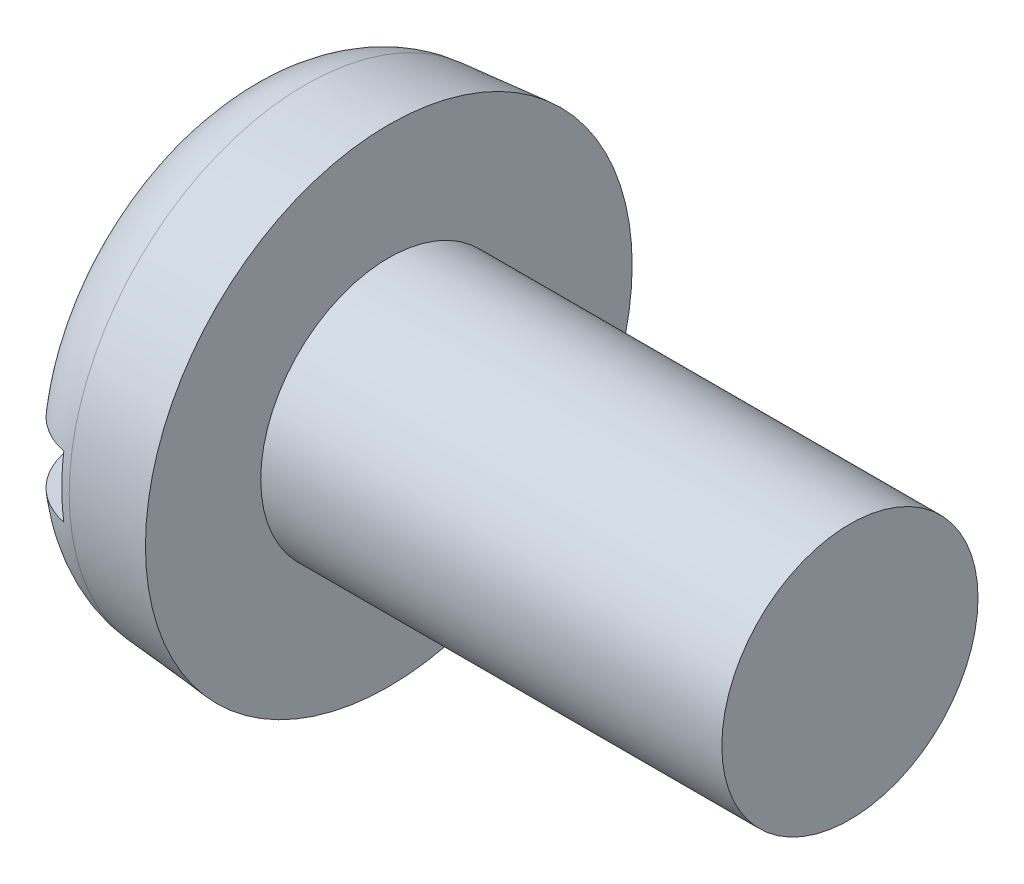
ISO-10303-21;
HEADER;
FILE_DESCRIPTION(('STEP AP214'),'2;1');
FILE_NAME('part.step','',(''),(''),'','','');
FILE_SCHEMA(('AUTOMOTIVE_DESIGN { 1 0 10303 214 1 1 1 1 }'));
ENDSEC;
DATA;
#1=APPLICATION_CONTEXT('core data for automotive mechanical design processes');
#2=APPLICATION_PROTOCOL_DEFINITION('international standard','automotive_design',2000,#1);
#3=PRODUCT_CONTEXT('',#1,'mechanical');
#4=PRODUCT('Part','Part','',(#3));
#5=PRODUCT_RELATED_PRODUCT_CATEGORY('part','',(#4));
#6=PRODUCT_DEFINITION_FORMATION('','',#4);
#7=PRODUCT_DEFINITION_CONTEXT('part definition',#1,'design');
#8=PRODUCT_DEFINITION('design','',#6,#7);
#9=PRODUCT_DEFINITION_SHAPE('','',#8);
#10=(LENGTH_UNIT() NAMED_UNIT(*) SI_UNIT(.MILLI.,.METRE.));
#11=(NAMED_UNIT(*) PLANE_ANGLE_UNIT() SI_UNIT($,.RADIAN.));
#12=(NAMED_UNIT(*) SI_UNIT($,.STERADIAN.) SOLID_ANGLE_UNIT());
#13=UNCERTAINTY_MEASURE_WITH_UNIT(LENGTH_MEASURE(1.E-05),#10,'distance_accuracy_value','');
#14=(GEOMETRIC_REPRESENTATION_CONTEXT(3) GLOBAL_UNCERTAINTY_ASSIGNED_CONTEXT((#13)) GLOBAL_UNIT_ASSIGNED_CONTEXT((#10,
#11,#12)) REPRESENTATION_CONTEXT('',''));
#15=CARTESIAN_POINT('',(0.,0.,0.));
#16=DIRECTION('',(0.,0.,1.));
#17=DIRECTION('',(1.,0.,0.));
#18=AXIS2_PLACEMENT_3D('',#15,#16,#17);
#19=CARTESIAN_POINT('',(0.,0.,0.));
#20=DIRECTION('',(-1.,0.,0.));
#21=DIRECTION('',(0.,0.,1.));
#22=AXIS2_PLACEMENT_3D('',#19,#20,#21);
#23=PLANE('',#22);
#24=DIRECTION('',(0.,0.,-1.));
#25=VECTOR('',#24,1.);
#26=CARTESIAN_POINT('',(0.,0.599999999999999,4.75));
#27=LINE('',#26,#25);
#28=CARTESIAN_POINT('',(0.,0.599999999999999,3.05466870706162));
#29=VERTEX_POINT('',#28);
#30=CARTESIAN_POINT('',(0.,0.599999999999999,-3.05466870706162));
#31=VERTEX_POINT('',#30);
#32=EDGE_CURVE('E85',#29,#31,#27,.T.);
#33=ORIENTED_EDGE('',*,*,#32,.F.);
#34=CARTESIAN_POINT('',(0.,0.,0.));
#35=DIRECTION('',(-1.,0.,0.));
#36=DIRECTION('',(0.,0.,1.));
#37=AXIS2_PLACEMENT_3D('',#34,#35,#36);
#38=CIRCLE('',#37,3.11303724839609);
#39=EDGE_CURVE('E91',#29,#31,#38,.T.);
#40=ORIENTED_EDGE('',*,*,#39,.T.);
#41=EDGE_LOOP('',(#33,#40));
#42=FACE_BOUND('',#41,.T.);
#43=ADVANCED_FACE('F32',(#42),#23,.T.);
#44=CARTESIAN_POINT('',(-25.4,0.,0.));
#45=DIRECTION('',(-1.,0.,0.));
#46=DIRECTION('',(0.,0.,1.));
#47=AXIS2_PLACEMENT_3D('',#44,#45,#46);
#48=CYLINDRICAL_SURFACE('',#47,2.5);
#49=CARTESIAN_POINT('',(12.,0.,0.));
#50=DIRECTION('',(-1.,0.,0.));
#51=DIRECTION('',(0.,0.,1.));
#52=AXIS2_PLACEMENT_3D('',#49,#50,#51);
#53=CIRCLE('',#52,2.5);
#54=CARTESIAN_POINT('',(12.,0.,2.5));
#55=VERTEX_POINT('',#54);
#56=EDGE_CURVE('E92',#55,#55,#53,.T.);
#57=ORIENTED_EDGE('',*,*,#56,.T.);
#58=EDGE_LOOP('',(#57));
#59=FACE_BOUND('',#58,.T.);
#60=CARTESIAN_POINT('',(3.,0.,0.));
#61=DIRECTION('',(-1.,0.,0.));
#62=DIRECTION('',(0.,0.,1.));
#63=AXIS2_PLACEMENT_3D('',#60,#61,#62);
#64=CIRCLE('',#63,2.5);
#65=CARTESIAN_POINT('',(3.,0.,2.5));
#66=VERTEX_POINT('',#65);
#67=EDGE_CURVE('E149',#66,#66,#64,.T.);
#68=ORIENTED_EDGE('',*,*,#67,.F.);
#69=EDGE_LOOP('',(#68));
#70=FACE_BOUND('',#69,.T.);
#71=ADVANCED_FACE('F137',(#59,#70),#48,.T.);
#72=CARTESIAN_POINT('',(12.,2.5,0.));
#73=DIRECTION('',(1.,0.,0.));
#74=DIRECTION('',(0.,0.,-1.));
#75=AXIS2_PLACEMENT_3D('',#72,#73,#74);
#76=PLANE('',#75);
#77=ORIENTED_EDGE('',*,*,#56,.F.);
#78=EDGE_LOOP('',(#77));
#79=FACE_BOUND('',#78,.T.);
#80=ADVANCED_FACE('F135',(#79),#76,.T.);
#81=DIRECTION('',(0.,0.,1.));
#82=VECTOR('',#81,1.);
#83=CARTESIAN_POINT('',(0.,-0.599999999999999,-4.75));
#84=LINE('',#83,#82);
#85=CARTESIAN_POINT('',(0.,-0.599999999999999,-3.05466870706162));
#86=VERTEX_POINT('',#85);
#87=CARTESIAN_POINT('',(0.,-0.6,3.05466870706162));
#88=VERTEX_POINT('',#87);
#89=EDGE_CURVE('E76',#86,#88,#84,.T.);
#90=ORIENTED_EDGE('',*,*,#89,.F.);
#91=EDGE_CURVE('E83',#86,#88,#38,.T.);
#92=ORIENTED_EDGE('',*,*,#91,.T.);
#93=EDGE_LOOP('',(#90,#92));
#94=FACE_BOUND('',#93,.T.);
#95=ADVANCED_FACE('F82',(#94),#23,.T.);
#96=CARTESIAN_POINT('',(0.,0.,0.));
#97=DIRECTION('',(1.,0.,0.));
#98=DIRECTION('',(0.,0.,-1.));
#99=AXIS2_PLACEMENT_3D('',#96,#97,#98);
#100=CONICAL_SURFACE('',#99,4.48753400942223,0.0872664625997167);
#101=CARTESIAN_POINT('',(1.36926638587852,0.,0.));
#102=DIRECTION('',(-1.,0.,0.));
#103=DIRECTION('',(0.,0.,1.));
#104=AXIS2_PLACEMENT_3D('',#101,#102,#103);
#105=CIRCLE('',#104,4.60732929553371);
#106=CARTESIAN_POINT('',(1.36926638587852,0.,4.60732929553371));
#107=VERTEX_POINT('',#106);
#108=EDGE_CURVE('E95',#107,#107,#105,.F.);
#109=ORIENTED_EDGE('',*,*,#108,.T.);
#110=EDGE_LOOP('',(#109));
#111=FACE_BOUND('',#110,.T.);
#112=CARTESIAN_POINT('',(3.,0.,0.));
#113=DIRECTION('',(-1.,0.,0.));
#114=DIRECTION('',(0.,0.,1.));
#115=AXIS2_PLACEMENT_3D('',#112,#113,#114);
#116=CIRCLE('',#115,4.75);
#117=CARTESIAN_POINT('',(3.,0.,4.75));
#118=VERTEX_POINT('',#117);
#119=EDGE_CURVE('E97',#118,#118,#116,.T.);
#120=ORIENTED_EDGE('',*,*,#119,.T.);
#121=EDGE_LOOP('',(#120));
#122=FACE_BOUND('',#121,.T.);
#123=ADVANCED_FACE('F128',(#111,#122),#100,.T.);
#124=CARTESIAN_POINT('',(3.,2.5,0.));
#125=DIRECTION('',(-1.,0.,0.));
#126=DIRECTION('',(0.,0.,1.));
#127=AXIS2_PLACEMENT_3D('',#124,#125,#126);
#128=PLANE('',#127);
#129=ORIENTED_EDGE('',*,*,#119,.F.);
#130=EDGE_LOOP('',(#129));
#131=FACE_BOUND('',#130,.T.);
#132=ORIENTED_EDGE('',*,*,#67,.T.);
#133=EDGE_LOOP('',(#132));
#134=FACE_BOUND('',#133,.T.);
#135=ADVANCED_FACE('F124',(#131,#134),#128,.F.);
#136=CARTESIAN_POINT('',(1.5,0.,0.));
#137=DIRECTION('',(-1.,0.,0.));
#138=DIRECTION('',(0.,0.,1.));
#139=AXIS2_PLACEMENT_3D('',#136,#137,#138);
#140=TOROIDAL_SURFACE('',#139,3.11303724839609,1.5);
#141=CARTESIAN_POINT('',(0.474243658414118,0.599999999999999,-4.16448807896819));
#142=CARTESIAN_POINT('',(0.535197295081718,0.599999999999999,-4.2222007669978));
#143=CARTESIAN_POINT('',(0.601040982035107,0.599999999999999,-4.27483380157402));
#144=CARTESIAN_POINT('',(0.740675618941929,0.599999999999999,-4.36835495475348));
#145=CARTESIAN_POINT('',(0.814475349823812,0.599999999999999,-4.40922990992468));
#146=CARTESIAN_POINT('',(0.967890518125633,0.599999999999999,-4.47797693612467));
#147=CARTESIAN_POINT('',(1.04750461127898,0.599999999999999,-4.50585200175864));
#148=CARTESIAN_POINT('',(1.21027286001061,0.599999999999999,-4.54777716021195));
#149=CARTESIAN_POINT('',(1.29342617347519,0.599999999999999,-4.56183052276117));
#150=CARTESIAN_POINT('',(1.46061786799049,0.599999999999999,-4.57568541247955));
#151=CARTESIAN_POINT('',(1.54465212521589,0.599999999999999,-4.57553672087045));
#152=CARTESIAN_POINT('',(1.71150157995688,0.599999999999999,-4.56111544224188));
#153=CARTESIAN_POINT('',(1.79431675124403,0.599999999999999,-4.546842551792));
#154=CARTESIAN_POINT('',(1.95628107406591,0.599999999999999,-4.50461633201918));
#155=CARTESIAN_POINT('',(2.03543426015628,0.599999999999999,-4.47667847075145));
#156=CARTESIAN_POINT('',(2.18794473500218,0.599999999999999,-4.40794662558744));
#157=CARTESIAN_POINT('',(2.26130200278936,0.599999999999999,-4.36715259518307));
#158=CARTESIAN_POINT('',(2.40037319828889,0.599999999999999,-4.27376142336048));
#159=CARTESIAN_POINT('',(2.46606492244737,0.599999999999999,-4.22113122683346));
#160=CARTESIAN_POINT('',(2.58775416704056,0.599999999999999,-4.10565865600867));
#161=CARTESIAN_POINT('',(2.64375146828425,0.599999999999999,-4.04281605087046));
#162=CARTESIAN_POINT('',(2.7448997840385,0.599999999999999,-3.90824759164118));
#163=CARTESIAN_POINT('',(2.78997229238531,0.599999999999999,-3.83646274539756));
#164=CARTESIAN_POINT('',(2.86758143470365,0.599999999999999,-3.6864129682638));
#165=CARTESIAN_POINT('',(2.90011748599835,0.599999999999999,-3.60814773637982));
#166=CARTESIAN_POINT('',(2.95215516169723,0.599999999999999,-3.44640006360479));
#167=CARTESIAN_POINT('',(2.9715017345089,0.599999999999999,-3.36286776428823));
#168=CARTESIAN_POINT('',(2.99613620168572,0.599999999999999,-3.19375865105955));
#169=CARTESIAN_POINT('',(3.00142305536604,0.599999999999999,-3.10818168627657));
#170=CARTESIAN_POINT('',(2.9978948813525,0.599999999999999,-2.93593785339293));
#171=CARTESIAN_POINT('',(2.98885075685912,0.599999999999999,-2.84927570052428));
#172=CARTESIAN_POINT('',(2.95661294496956,0.599999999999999,-2.67862588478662));
#173=CARTESIAN_POINT('',(2.93341783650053,0.599999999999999,-2.59463849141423));
#174=CARTESIAN_POINT('',(2.87305940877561,0.599999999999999,-2.43009011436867));
#175=CARTESIAN_POINT('',(2.8356478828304,0.599999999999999,-2.3496201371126));
#176=CARTESIAN_POINT('',(2.74798933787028,0.599999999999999,-2.1959917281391));
#177=CARTESIAN_POINT('',(2.69774036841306,0.599999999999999,-2.12283440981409));
#178=CARTESIAN_POINT('',(2.58515210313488,0.599999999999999,-1.98517825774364));
#179=CARTESIAN_POINT('',(2.52268993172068,0.599999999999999,-1.92077976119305));
#180=CARTESIAN_POINT('',(2.3876474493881,0.599999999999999,-1.80360821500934));
#181=CARTESIAN_POINT('',(2.31506700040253,0.599999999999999,-1.75083532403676));
#182=CARTESIAN_POINT('',(2.16324197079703,0.599999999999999,-1.65981326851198));
#183=CARTESIAN_POINT('',(2.08415844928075,0.599999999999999,-1.62129637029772));
#184=CARTESIAN_POINT('',(1.92036681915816,0.599999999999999,-1.55909823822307));
#185=CARTESIAN_POINT('',(1.83566227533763,0.599999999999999,-1.53540769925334));
#186=CARTESIAN_POINT('',(1.66868507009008,0.599999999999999,-1.50512561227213));
#187=CARTESIAN_POINT('',(1.58658829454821,0.599999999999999,-1.4975631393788));
#188=CARTESIAN_POINT('',(1.42235866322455,0.599999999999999,-1.49703912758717));
#189=CARTESIAN_POINT('',(1.34022582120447,0.599999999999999,-1.50407401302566));
#190=CARTESIAN_POINT('',(1.18200056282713,0.599999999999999,-1.53172166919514));
#191=CARTESIAN_POINT('',(1.10580089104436,0.599999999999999,-1.55172937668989));
#192=CARTESIAN_POINT('',(0.957649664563,0.599999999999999,-1.60381093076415));
#193=CARTESIAN_POINT('',(0.885698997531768,0.599999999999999,-1.63588728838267));
#194=CARTESIAN_POINT('',(0.745245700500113,0.599999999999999,-1.71223681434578));
#195=CARTESIAN_POINT('',(0.676958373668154,0.599999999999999,-1.75690511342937));
#196=CARTESIAN_POINT('',(0.548253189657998,0.599999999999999,-1.85641398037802));
#197=CARTESIAN_POINT('',(0.487837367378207,0.599999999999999,-1.91125716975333));
#198=CARTESIAN_POINT('',(0.372604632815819,0.599999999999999,-2.0333995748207));
#199=CARTESIAN_POINT('',(0.318393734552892,0.599999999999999,-2.10127142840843));
#200=CARTESIAN_POINT('',(0.22172170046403,0.599999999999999,-2.24492747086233));
#201=CARTESIAN_POINT('',(0.179262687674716,0.599999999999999,-2.32071308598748));
#202=CARTESIAN_POINT('',(0.106126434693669,0.599999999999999,-2.48060945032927));
#203=CARTESIAN_POINT('',(0.0758504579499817,0.599999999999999,-2.56490423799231));
#204=CARTESIAN_POINT('',(0.0299480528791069,0.599999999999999,-2.737393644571));
#205=CARTESIAN_POINT('',(0.0143211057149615,0.599999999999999,-2.82558812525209));
#206=CARTESIAN_POINT('',(-0.00166405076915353,0.599999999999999,-3.00295249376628));
#207=CARTESIAN_POINT('',(-0.0020913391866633,0.599999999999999,-3.09211612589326));
#208=CARTESIAN_POINT('',(0.012315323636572,0.599999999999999,-3.26923006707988));
#209=CARTESIAN_POINT('',(0.0271518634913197,0.599999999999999,-3.35718016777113));
#210=CARTESIAN_POINT('',(0.0713942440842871,0.599999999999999,-3.52770551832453));
#211=CARTESIAN_POINT('',(0.100543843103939,0.599999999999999,-3.61034739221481));
#212=CARTESIAN_POINT('',(0.172532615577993,0.599999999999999,-3.7693538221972));
#213=CARTESIAN_POINT('',(0.215353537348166,0.599999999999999,-3.84572657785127));
#214=CARTESIAN_POINT('',(0.294810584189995,0.599999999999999,-3.9625299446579));
#215=CARTESIAN_POINT('',(0.327631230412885,0.599999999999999,-4.00560511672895));
#216=CARTESIAN_POINT('',(0.397705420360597,0.599999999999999,-4.08798619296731));
#217=CARTESIAN_POINT('',(0.434958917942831,0.599999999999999,-4.12729213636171));
#218=CARTESIAN_POINT('',(0.474243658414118,0.599999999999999,-4.16448807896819));
#219=B_SPLINE_CURVE_WITH_KNOTS('',3,(#141,#142,#143,#144,#145,#146,#147,#148,#149,#150,#151,
#152,#153,#154,#155,#156,#157,#158,#159,#160,#161,#162,#163,#164,#165,#166,#167,#168,#169,#170,
#171,#172,#173,#174,#175,#176,#177,#178,#179,#180,#181,#182,#183,#184,#185,#186,#187,#188,#189,
#190,#191,#192,#193,#194,#195,#196,#197,#198,#199,#200,#201,#202,#203,#204,#205,#206,#207,#208,
#209,#210,#211,#212,#213,#214,#215,#216,#217,#218),.UNSPECIFIED.,.T.,.F.,(4,2,2,2,2,2,2,2,2,2,2,
2,2,2,2,2,2,2,2,2,2,2,2,2,2,2,2,2,2,2,2,2,2,2,2,2,2,2,4),(0.,0.251627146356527,
0.503534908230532,0.755384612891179,1.00717472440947,1.25808229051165,1.50899524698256,
1.75962483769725,2.01025533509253,2.26159466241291,2.5129396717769,2.76604060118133,
3.01915329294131,3.27519243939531,3.53125053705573,3.79144347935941,4.05166255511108,
4.31665070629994,4.58167914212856,4.84952563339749,5.1173757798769,5.37990411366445,
5.64226751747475,5.88833003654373,6.13433228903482,6.36961414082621,6.60494497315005,
6.84869102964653,7.09249997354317,7.35191672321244,7.61138030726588,7.87880123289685,
8.14621268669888,8.41240865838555,8.67864978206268,8.94028930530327,9.20158098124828,
9.36375686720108,9.52593106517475),.UNSPECIFIED.);
#220=CARTESIAN_POINT('',(1.2,0.599999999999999,-4.54328342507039));
#221=VERTEX_POINT('',#220);
#222=EDGE_CURVE('E11',#31,#221,#219,.T.);
#223=ORIENTED_EDGE('',*,*,#222,.F.);
#224=ORIENTED_EDGE('',*,*,#39,.F.);
#225=CARTESIAN_POINT('',(0.642058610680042,0.599999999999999,1.78444467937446));
#226=CARTESIAN_POINT('',(0.708203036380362,0.599999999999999,1.73578880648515));
#227=CARTESIAN_POINT('',(0.778279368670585,0.599999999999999,1.69241067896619));
#228=CARTESIAN_POINT('',(0.924661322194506,0.599999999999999,1.61775076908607));
#229=CARTESIAN_POINT('',(1.00097010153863,0.599999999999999,1.58647516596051));
#230=CARTESIAN_POINT('',(1.15801751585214,0.599999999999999,1.537335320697));
#231=CARTESIAN_POINT('',(1.23876602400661,0.599999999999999,1.51950238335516));
#232=CARTESIAN_POINT('',(1.40212199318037,0.599999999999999,1.49831173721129));
#233=CARTESIAN_POINT('',(1.48472861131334,0.599999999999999,1.49494759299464));
#234=CARTESIAN_POINT('',(1.64595983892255,0.599999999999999,1.50270631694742));
#235=CARTESIAN_POINT('',(1.72461257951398,0.599999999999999,1.51326068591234));
#236=CARTESIAN_POINT('',(1.8790539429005,0.599999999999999,1.54733501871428));
#237=CARTESIAN_POINT('',(1.95484205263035,0.599999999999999,1.57085729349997));
#238=CARTESIAN_POINT('',(2.10217401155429,0.599999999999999,1.63005609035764));
#239=CARTESIAN_POINT('',(2.17368023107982,0.599999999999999,1.6658257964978));
#240=CARTESIAN_POINT('',(2.310172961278,0.599999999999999,1.74815983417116));
#241=CARTESIAN_POINT('',(2.37515789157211,0.599999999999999,1.79472677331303));
#242=CARTESIAN_POINT('',(2.50111037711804,0.599999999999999,1.90052230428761));
#243=CARTESIAN_POINT('',(2.56156048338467,0.599999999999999,1.96036731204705));
#244=CARTESIAN_POINT('',(2.67210720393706,0.599999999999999,2.08896077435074));
#245=CARTESIAN_POINT('',(2.72220143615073,0.599999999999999,2.15771127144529));
#246=CARTESIAN_POINT('',(2.81284735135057,0.599999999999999,2.30563751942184));
#247=CARTESIAN_POINT('',(2.85285618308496,0.599999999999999,2.38514674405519));
#248=CARTESIAN_POINT('',(2.91905433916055,0.599999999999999,2.54972911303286));
#249=CARTESIAN_POINT('',(2.94524280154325,0.599999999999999,2.63480260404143));
#250=CARTESIAN_POINT('',(2.98307112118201,0.599999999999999,2.80866920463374));
#251=CARTESIAN_POINT('',(2.9946229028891,0.599999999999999,2.89748154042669));
#252=CARTESIAN_POINT('',(3.00240662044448,0.599999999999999,3.07577878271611));
#253=CARTESIAN_POINT('',(2.998639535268,0.599999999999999,3.16526364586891));
#254=CARTESIAN_POINT('',(2.97592433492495,0.599999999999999,3.34090743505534));
#255=CARTESIAN_POINT('',(2.95720740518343,0.599999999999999,3.42709622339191));
#256=CARTESIAN_POINT('',(2.90529569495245,0.599999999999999,3.59499998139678));
#257=CARTESIAN_POINT('',(2.87210231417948,0.599999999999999,3.67671538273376));
#258=CARTESIAN_POINT('',(2.7928517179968,0.599999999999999,3.83175947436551));
#259=CARTESIAN_POINT('',(2.7470416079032,0.599999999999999,3.90521449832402));
#260=CARTESIAN_POINT('',(2.64356788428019,0.599999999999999,4.04323981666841));
#261=CARTESIAN_POINT('',(2.58590525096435,0.599999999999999,4.10781084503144));
#262=CARTESIAN_POINT('',(2.46128327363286,0.599999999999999,4.22525214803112));
#263=CARTESIAN_POINT('',(2.39447165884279,0.599999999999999,4.27827922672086));
#264=CARTESIAN_POINT('',(2.25282231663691,0.599999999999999,4.37223374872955));
#265=CARTESIAN_POINT('',(2.17798504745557,0.599999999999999,4.41316188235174));
#266=CARTESIAN_POINT('',(2.02319107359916,0.599999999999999,4.48136089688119));
#267=CARTESIAN_POINT('',(1.94329070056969,0.599999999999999,4.50875968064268));
#268=CARTESIAN_POINT('',(1.78001182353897,0.599999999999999,4.54967680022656));
#269=CARTESIAN_POINT('',(1.69663343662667,0.599999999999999,4.5631956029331));
#270=CARTESIAN_POINT('',(1.52922201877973,0.599999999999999,4.57591948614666));
#271=CARTESIAN_POINT('',(1.44519451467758,0.599999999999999,4.57519739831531));
#272=CARTESIAN_POINT('',(1.27845728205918,0.599999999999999,4.55963992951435));
#273=CARTESIAN_POINT('',(1.19574753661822,0.599999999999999,4.54480472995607));
#274=CARTESIAN_POINT('',(1.0340786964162,0.599999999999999,4.50147996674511));
#275=CARTESIAN_POINT('',(0.95511580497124,0.599999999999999,4.47300456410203));
#276=CARTESIAN_POINT('',(0.803072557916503,0.599999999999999,4.40323812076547));
#277=CARTESIAN_POINT('',(0.729992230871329,0.599999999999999,4.36194701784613));
#278=CARTESIAN_POINT('',(0.59154832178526,0.599999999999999,4.26761123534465));
#279=CARTESIAN_POINT('',(0.526207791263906,0.599999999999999,4.21453273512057));
#280=CARTESIAN_POINT('',(0.405289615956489,0.599999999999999,4.09822911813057));
#281=CARTESIAN_POINT('',(0.349712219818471,0.599999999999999,4.03500374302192));
#282=CARTESIAN_POINT('',(0.249458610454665,0.599999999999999,3.89973755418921));
#283=CARTESIAN_POINT('',(0.204862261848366,0.599999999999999,3.82763756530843));
#284=CARTESIAN_POINT('',(0.128249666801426,0.599999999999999,3.67704118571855));
#285=CARTESIAN_POINT('',(0.0962340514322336,0.599999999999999,3.59854447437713));
#286=CARTESIAN_POINT('',(0.0452695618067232,0.599999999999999,3.43641182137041));
#287=CARTESIAN_POINT('',(0.0264776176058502,0.599999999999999,3.35272657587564));
#288=CARTESIAN_POINT('',(0.00296961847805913,0.599999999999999,3.18340853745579));
#289=CARTESIAN_POINT('',(-0.00174593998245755,0.599999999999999,3.09777567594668));
#290=CARTESIAN_POINT('',(0.00293340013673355,0.599999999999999,2.92551527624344));
#291=CARTESIAN_POINT('',(0.0125572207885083,0.599999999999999,2.83889398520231));
#292=CARTESIAN_POINT('',(0.045943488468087,0.599999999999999,2.66839997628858));
#293=CARTESIAN_POINT('',(0.0697105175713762,0.599999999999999,2.58452815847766));
#294=CARTESIAN_POINT('',(0.131206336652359,0.599999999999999,2.42028022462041));
#295=CARTESIAN_POINT('',(0.169188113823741,0.599999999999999,2.3399989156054));
#296=CARTESIAN_POINT('',(0.257932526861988,0.599999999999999,2.18690708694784));
#297=CARTESIAN_POINT('',(0.308683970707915,0.599999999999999,2.11409010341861));
#298=CARTESIAN_POINT('',(0.405756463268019,0.599999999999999,1.9970345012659));
#299=CARTESIAN_POINT('',(0.449343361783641,0.599999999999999,1.9505006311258));
#300=CARTESIAN_POINT('',(0.54185180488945,0.599999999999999,1.86306846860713));
#301=CARTESIAN_POINT('',(0.590773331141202,0.599999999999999,1.82217015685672));
#302=CARTESIAN_POINT('',(0.642058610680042,0.599999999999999,1.78444467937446));
#303=B_SPLINE_CURVE_WITH_KNOTS('',3,(#225,#226,#227,#228,#229,#230,#231,#232,#233,#234,#235,
#236,#237,#238,#239,#240,#241,#242,#243,#244,#245,#246,#247,#248,#249,#250,#251,#252,#253,#254,
#255,#256,#257,#258,#259,#260,#261,#262,#263,#264,#265,#266,#267,#268,#269,#270,#271,#272,#273,
#274,#275,#276,#277,#278,#279,#280,#281,#282,#283,#284,#285,#286,#287,#288,#289,#290,#291,#292,
#293,#294,#295,#296,#297,#298,#299,#300,#301,#302),.UNSPECIFIED.,.T.,.F.,(4,2,2,2,2,2,2,2,2,2,2,
2,2,2,2,2,2,2,2,2,2,2,2,2,2,2,2,2,2,2,2,2,2,2,2,2,2,2,4),(0.,0.24612605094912,0.492377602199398,
0.739200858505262,0.985914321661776,1.22285638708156,1.45984069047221,1.69866969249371,
1.93755643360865,2.19161852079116,2.4457389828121,2.7115111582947,2.97729990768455,
3.24468054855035,3.51204410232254,3.77535136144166,4.03863316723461,4.29708605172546,
4.55551757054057,4.81018291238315,5.06483372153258,5.31702870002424,5.56921519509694,
5.82011227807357,6.07100613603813,6.32164008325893,6.57227524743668,6.8236390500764,
7.07500925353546,7.32815697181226,7.58131738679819,7.83743366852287,8.09355898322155,
8.35381727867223,8.61415993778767,8.87937525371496,9.14435892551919,9.33519415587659,
9.52602873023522),.UNSPECIFIED.);
#304=CARTESIAN_POINT('',(1.2,0.599999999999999,4.54328342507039));
#305=VERTEX_POINT('',#304);
#306=EDGE_CURVE('E109',#305,#29,#303,.T.);
#307=ORIENTED_EDGE('',*,*,#306,.F.);
#308=CARTESIAN_POINT('',(1.2,0.,0.));
#309=DIRECTION('',(-1.,0.,0.));
#310=DIRECTION('',(0.,0.,1.));
#311=AXIS2_PLACEMENT_3D('',#308,#309,#310);
#312=CIRCLE('',#311,4.582731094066);
#313=CARTESIAN_POINT('',(1.2,-0.6,4.54328342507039));
#314=VERTEX_POINT('',#313);
#315=EDGE_CURVE('E103',#305,#314,#312,.F.);
#316=ORIENTED_EDGE('',*,*,#315,.T.);
#317=CARTESIAN_POINT('',(0.642058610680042,-0.6,1.78444467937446));
#318=CARTESIAN_POINT('',(0.570752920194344,-0.6,1.83690352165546));
#319=CARTESIAN_POINT('',(0.503916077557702,-0.6,1.89557553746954));
#320=CARTESIAN_POINT('',(0.380973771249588,-0.6,2.02337981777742));
#321=CARTESIAN_POINT('',(0.324888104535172,-0.6,2.09253096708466));
#322=CARTESIAN_POINT('',(0.225075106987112,-0.6,2.23912059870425));
#323=CARTESIAN_POINT('',(0.181331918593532,-0.6,2.31654826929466));
#324=CARTESIAN_POINT('',(0.10735821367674,-0.6,2.4775679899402));
#325=CARTESIAN_POINT('',(0.0771217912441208,-0.6,2.56115732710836));
#326=CARTESIAN_POINT('',(0.0308710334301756,-0.6,2.732939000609));
#327=CARTESIAN_POINT('',(0.0149771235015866,-0.6,2.82116384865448));
#328=CARTESIAN_POINT('',(-0.0015567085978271,-0.6,2.99904386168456));
#329=CARTESIAN_POINT('',(-0.00219606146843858,-0.6,3.08869907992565));
#330=CARTESIAN_POINT('',(0.0118531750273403,-0.6,3.26558059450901));
#331=CARTESIAN_POINT('',(0.0263341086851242,-0.6,3.35282334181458));
#332=CARTESIAN_POINT('',(0.0700194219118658,-0.6,3.52354291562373));
#333=CARTESIAN_POINT('',(0.099222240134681,-0.6,3.60702014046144));
#334=CARTESIAN_POINT('',(0.170926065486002,-0.6,3.76619303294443));
#335=CARTESIAN_POINT('',(0.213170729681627,-0.6,3.84200419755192));
#336=CARTESIAN_POINT('',(0.309975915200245,-0.6,3.98530836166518));
#337=CARTESIAN_POINT('',(0.364535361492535,-0.6,4.05280208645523));
#338=CARTESIAN_POINT('',(0.483508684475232,-0.6,4.1764763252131));
#339=CARTESIAN_POINT('',(0.5477595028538,-0.6,4.23281374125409));
#340=CARTESIAN_POINT('',(0.684891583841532,-0.6,4.33376627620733));
#341=CARTESIAN_POINT('',(0.757772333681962,-0.6,4.37838209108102));
#342=CARTESIAN_POINT('',(0.909277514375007,-0.6,4.45415785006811));
#343=CARTESIAN_POINT('',(0.98783477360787,-0.6,4.4854521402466));
#344=CARTESIAN_POINT('',(1.14910626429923,-0.6,4.53432193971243));
#345=CARTESIAN_POINT('',(1.23182034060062,-0.6,4.55189796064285));
#346=CARTESIAN_POINT('',(1.39854874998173,-0.6,4.57274942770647));
#347=CARTESIAN_POINT('',(1.48255291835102,-0.6,4.57610622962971));
#348=CARTESIAN_POINT('',(1.64992840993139,-0.6,4.56864397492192));
#349=CARTESIAN_POINT('',(1.73329974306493,-0.6,4.55782514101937));
#350=CARTESIAN_POINT('',(1.89690556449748,-0.6,4.5223590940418));
#351=CARTESIAN_POINT('',(1.97714487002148,-0.6,4.49773409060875));
#352=CARTESIAN_POINT('',(2.13236381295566,-0.6,4.43539277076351));
#353=CARTESIAN_POINT('',(2.20734343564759,-0.6,4.39767641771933));
#354=CARTESIAN_POINT('',(2.35011399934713,-0.6,4.31014761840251));
#355=CARTESIAN_POINT('',(2.41788774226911,-0.6,4.26030712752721));
#356=CARTESIAN_POINT('',(2.54417141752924,-0.6,4.15002218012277));
#357=CARTESIAN_POINT('',(2.60268114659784,-0.6,4.08957749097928));
#358=CARTESIAN_POINT('',(2.70919785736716,-0.6,3.9593981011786));
#359=CARTESIAN_POINT('',(2.75713464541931,-0.6,3.88960598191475));
#360=CARTESIAN_POINT('',(2.84075534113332,-0.6,3.74303514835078));
#361=CARTESIAN_POINT('',(2.8764387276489,-0.6,3.66625613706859));
#362=CARTESIAN_POINT('',(2.93498131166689,-0.6,3.50699921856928));
#363=CARTESIAN_POINT('',(2.95769541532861,-0.6,3.42446799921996));
#364=CARTESIAN_POINT('',(2.98917609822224,-0.6,3.25679047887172));
#365=CARTESIAN_POINT('',(2.99794169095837,-0.6,3.17164399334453));
#366=CARTESIAN_POINT('',(3.00144063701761,-0.6,2.99973325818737));
#367=CARTESIAN_POINT('',(2.99595250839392,-0.6,2.91296452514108));
#368=CARTESIAN_POINT('',(2.97076041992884,-0.6,2.74151789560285));
#369=CARTESIAN_POINT('',(2.95105508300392,-0.6,2.6568402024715));
#370=CARTESIAN_POINT('',(2.8975856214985,-0.6,2.49032583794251));
#371=CARTESIAN_POINT('',(2.86356984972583,-0.6,2.40856994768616));
#372=CARTESIAN_POINT('',(2.78246737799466,-0.6,2.25181146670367));
#373=CARTESIAN_POINT('',(2.73537879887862,-0.6,2.17680984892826));
#374=CARTESIAN_POINT('',(2.6287380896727,-0.6,2.03476656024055));
#375=CARTESIAN_POINT('',(2.56903700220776,-0.6,1.96783656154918));
#376=CARTESIAN_POINT('',(2.43909597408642,-0.6,1.84509773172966));
#377=CARTESIAN_POINT('',(2.36885525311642,-0.6,1.7892897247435));
#378=CARTESIAN_POINT('',(2.22077231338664,-0.6,1.6915159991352));
#379=CARTESIAN_POINT('',(2.14305625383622,-0.6,1.64935982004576));
#380=CARTESIAN_POINT('',(1.98134627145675,-0.6,1.57962775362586));
#381=CARTESIAN_POINT('',(1.89735630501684,-0.6,1.55204276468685));
#382=CARTESIAN_POINT('',(1.73074700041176,-0.6,1.51405337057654));
#383=CARTESIAN_POINT('',(1.64833577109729,-0.6,1.50273689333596));
#384=CARTESIAN_POINT('',(1.48280159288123,-0.6,1.49493998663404));
#385=CARTESIAN_POINT('',(1.39967868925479,-0.6,1.49845862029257));
#386=CARTESIAN_POINT('',(1.23954957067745,-0.6,1.5195684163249));
#387=CARTESIAN_POINT('',(1.16244637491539,-0.6,1.53644040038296));
#388=CARTESIAN_POINT('',(1.01210690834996,-0.6,1.58254863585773));
#389=CARTESIAN_POINT('',(0.938866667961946,-0.6,1.61177190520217));
#390=CARTESIAN_POINT('',(0.828774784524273,-0.6,1.66615585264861));
#391=CARTESIAN_POINT('',(0.789995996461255,-0.6,1.68752043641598));
#392=CARTESIAN_POINT('',(0.714458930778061,-0.6,1.73355428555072));
#393=CARTESIAN_POINT('',(0.677700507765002,-0.6,1.75822331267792));
#394=CARTESIAN_POINT('',(0.642058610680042,-0.6,1.78444467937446));
#395=B_SPLINE_CURVE_WITH_KNOTS('',3,(#317,#318,#319,#320,#321,#322,#323,#324,#325,#326,#327,
#328,#329,#330,#331,#332,#333,#334,#335,#336,#337,#338,#339,#340,#341,#342,#343,#344,#345,#346,
#347,#348,#349,#350,#351,#352,#353,#354,#355,#356,#357,#358,#359,#360,#361,#362,#363,#364,#365,
#366,#367,#368,#369,#370,#371,#372,#373,#374,#375,#376,#377,#378,#379,#380,#381,#382,#383,#384,
#385,#386,#387,#388,#389,#390,#391,#392,#393,#394),.UNSPECIFIED.,.T.,.F.,(4,2,2,2,2,2,2,2,2,2,2,
2,2,2,2,2,2,2,2,2,2,2,2,2,2,2,2,2,2,2,2,2,2,2,2,2,2,2,4),(0.,0.265404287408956,
0.531292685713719,0.796837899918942,1.0622668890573,1.32990433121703,1.59755176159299,
1.86157117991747,2.12556260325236,2.38466409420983,2.64374297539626,2.89886888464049,
3.15397964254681,3.40645291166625,3.65891676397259,3.90993416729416,4.16094762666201,
4.41155844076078,4.66216995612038,4.91336677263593,5.1645691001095,5.41739205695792,
5.67022576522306,5.92583525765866,6.18146282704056,6.44108615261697,6.70073462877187,
6.96515356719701,7.22961053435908,7.49738541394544,7.76518012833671,8.0290593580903,
8.2927735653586,8.54103382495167,8.78927840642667,9.02499451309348,9.2604634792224,
9.39313443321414,9.5257958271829),.UNSPECIFIED.);
#396=EDGE_CURVE('E90',#88,#314,#395,.T.);
#397=ORIENTED_EDGE('',*,*,#396,.F.);
#398=ORIENTED_EDGE('',*,*,#91,.F.);
#399=CARTESIAN_POINT('',(0.474243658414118,-0.599999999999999,-4.16448807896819));
#400=CARTESIAN_POINT('',(0.412409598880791,-0.599999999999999,-4.10593108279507));
#401=CARTESIAN_POINT('',(0.35551684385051,-0.599999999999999,-4.04205754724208));
#402=CARTESIAN_POINT('',(0.253261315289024,-0.599999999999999,-3.90557965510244));
#403=CARTESIAN_POINT('',(0.207914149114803,-0.599999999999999,-3.83296367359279));
#404=CARTESIAN_POINT('',(0.130063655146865,-0.599999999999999,-3.68123851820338));
#405=CARTESIAN_POINT('',(0.0975468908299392,-0.599999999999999,-3.6021362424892));
#406=CARTESIAN_POINT('',(0.0461131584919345,-0.599999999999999,-3.43965944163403));
#407=CARTESIAN_POINT('',(0.027192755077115,-0.599999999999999,-3.35628600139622));
#408=CARTESIAN_POINT('',(0.00320871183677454,-0.599999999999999,-3.18666752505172));
#409=CARTESIAN_POINT('',(-0.00170544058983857,-0.599999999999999,-3.10040138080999));
#410=CARTESIAN_POINT('',(0.00275015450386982,-0.599999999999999,-2.92823768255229));
#411=CARTESIAN_POINT('',(0.012121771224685,-0.599999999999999,-2.84234017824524));
#412=CARTESIAN_POINT('',(0.0450616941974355,-0.599999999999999,-2.67171740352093));
#413=CARTESIAN_POINT('',(0.0688809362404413,-0.6,-2.58704058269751));
#414=CARTESIAN_POINT('',(0.130163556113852,-0.6,-2.42277478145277));
#415=CARTESIAN_POINT('',(0.16762851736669,-0.6,-2.34318639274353));
#416=CARTESIAN_POINT('',(0.255857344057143,-0.6,-2.19000637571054));
#417=CARTESIAN_POINT('',(0.306828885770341,-0.6,-2.11653425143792));
#418=CARTESIAN_POINT('',(0.420399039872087,-0.6,-1.97917572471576));
#419=CARTESIAN_POINT('',(0.482999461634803,-0.6,-1.91529081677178));
#420=CARTESIAN_POINT('',(0.618096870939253,-0.6,-1.79922493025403));
#421=CARTESIAN_POINT('',(0.69057820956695,-0.6,-1.74702578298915));
#422=CARTESIAN_POINT('',(0.843593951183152,-0.6,-1.65617143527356));
#423=CARTESIAN_POINT('',(0.924125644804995,-0.6,-1.61751169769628));
#424=CARTESIAN_POINT('',(1.08726160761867,-0.6,-1.5568894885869));
#425=CARTESIAN_POINT('',(1.16962117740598,-0.6,-1.53427068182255));
#426=CARTESIAN_POINT('',(1.33705452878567,-0.6,-1.50426955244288));
#427=CARTESIAN_POINT('',(1.42212670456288,-0.6,-1.49687837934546));
#428=CARTESIAN_POINT('',(1.58668515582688,-0.6,-1.4977182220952));
#429=CARTESIAN_POINT('',(1.66617813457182,-0.6,-1.50497326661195));
#430=CARTESIAN_POINT('',(1.82279518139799,-0.6,-1.53279061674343));
#431=CARTESIAN_POINT('',(1.89991905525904,-0.6,-1.55335401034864));
#432=CARTESIAN_POINT('',(2.04948924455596,-0.6,-1.6067410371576));
#433=CARTESIAN_POINT('',(2.1219498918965,-0.6,-1.63952477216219));
#434=CARTESIAN_POINT('',(2.26079027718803,-0.6,-1.71610282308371));
#435=CARTESIAN_POINT('',(2.32716854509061,-0.6,-1.75989979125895));
#436=CARTESIAN_POINT('',(2.45624783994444,-0.6,-1.86010993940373));
#437=CARTESIAN_POINT('',(2.51847841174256,-0.6,-1.91712921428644));
#438=CARTESIAN_POINT('',(2.6330655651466,-0.6,-2.04035161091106));
#439=CARTESIAN_POINT('',(2.68541975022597,-0.6,-2.10655695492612));
#440=CARTESIAN_POINT('',(2.78137899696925,-0.6,-2.24995520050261));
#441=CARTESIAN_POINT('',(2.82440841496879,-0.6,-2.32753422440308));
#442=CARTESIAN_POINT('',(2.89698988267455,-0.6,-2.48876491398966));
#443=CARTESIAN_POINT('',(2.92654080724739,-0.599999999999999,-2.57241708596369));
#444=CARTESIAN_POINT('',(2.97147838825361,-0.599999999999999,-2.74436421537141));
#445=CARTESIAN_POINT('',(2.98671795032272,-0.599999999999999,-2.83269773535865));
#446=CARTESIAN_POINT('',(3.0019280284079,-0.599999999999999,-3.01067371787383));
#447=CARTESIAN_POINT('',(3.00189936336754,-0.599999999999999,-3.10031610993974));
#448=CARTESIAN_POINT('',(2.98653324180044,-0.599999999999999,-3.27703669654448));
#449=CARTESIAN_POINT('',(2.97140689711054,-0.599999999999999,-3.36413320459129));
#450=CARTESIAN_POINT('',(2.92646546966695,-0.599999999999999,-3.53445278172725));
#451=CARTESIAN_POINT('',(2.89665181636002,-0.599999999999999,-3.6176762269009));
#452=CARTESIAN_POINT('',(2.82379055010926,-0.599999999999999,-3.77624709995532));
#453=CARTESIAN_POINT('',(2.78099811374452,-0.599999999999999,-3.85171179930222));
#454=CARTESIAN_POINT('',(2.68316564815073,-0.599999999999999,-3.99423591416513));
#455=CARTESIAN_POINT('',(2.62812664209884,-0.599999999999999,-4.06129603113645));
#456=CARTESIAN_POINT('',(2.50827792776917,-0.599999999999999,-4.18404243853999));
#457=CARTESIAN_POINT('',(2.44362896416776,-0.599999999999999,-4.23988572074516));
#458=CARTESIAN_POINT('',(2.3057910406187,-0.599999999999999,-4.33979100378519));
#459=CARTESIAN_POINT('',(2.23260257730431,-0.599999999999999,-4.38385368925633));
#460=CARTESIAN_POINT('',(2.08057460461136,-0.599999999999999,-4.45849174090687));
#461=CARTESIAN_POINT('',(2.00180044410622,-0.599999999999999,-4.4892002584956));
#462=CARTESIAN_POINT('',(1.84020059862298,-0.599999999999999,-4.53687031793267));
#463=CARTESIAN_POINT('',(1.75737522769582,-0.599999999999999,-4.55383292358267));
#464=CARTESIAN_POINT('',(1.59053176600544,-0.599999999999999,-4.5734537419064));
#465=CARTESIAN_POINT('',(1.50652325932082,-0.599999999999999,-4.57619356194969));
#466=CARTESIAN_POINT('',(1.33921886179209,-0.599999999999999,-4.56750581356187));
#467=CARTESIAN_POINT('',(1.25592315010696,-0.599999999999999,-4.55607478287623));
#468=CARTESIAN_POINT('',(1.09252935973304,-0.599999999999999,-4.51940184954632));
#469=CARTESIAN_POINT('',(1.01242810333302,-0.599999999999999,-4.49417405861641));
#470=CARTESIAN_POINT('',(0.857658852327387,-0.599999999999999,-4.4306700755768));
#471=CARTESIAN_POINT('',(0.782984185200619,-0.599999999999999,-4.39241024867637));
#472=CARTESIAN_POINT('',(0.669478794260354,-0.599999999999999,-4.32168602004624));
#473=CARTESIAN_POINT('',(0.628240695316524,-0.599999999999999,-4.29300657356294));
#474=CARTESIAN_POINT('',(0.548844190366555,-0.599999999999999,-4.23166298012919));
#475=CARTESIAN_POINT('',(0.510685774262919,-0.599999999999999,-4.1989988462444));
#476=CARTESIAN_POINT('',(0.474243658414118,-0.599999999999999,-4.16448807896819));
#477=B_SPLINE_CURVE_WITH_KNOTS('',3,(#399,#400,#401,#402,#403,#404,#405,#406,#407,#408,#409,
#410,#411,#412,#413,#414,#415,#416,#417,#418,#419,#420,#421,#422,#423,#424,#425,#426,#427,#428,
#429,#430,#431,#432,#433,#434,#435,#436,#437,#438,#439,#440,#441,#442,#443,#444,#445,#446,#447,
#448,#449,#450,#451,#452,#453,#454,#455,#456,#457,#458,#459,#460,#461,#462,#463,#464,#465,#466,
#467,#468,#469,#470,#471,#472,#473,#474,#475,#476),.UNSPECIFIED.,.T.,.F.,(4,2,2,2,2,2,2,2,2,2,2,
2,2,2,2,2,2,2,2,2,2,2,2,2,2,2,2,2,2,2,2,2,2,2,2,2,2,2,4),(0.,0.25529644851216,0.510936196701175,
0.766307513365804,1.02161428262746,1.27963589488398,1.53769127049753,1.80036244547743,
2.06306411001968,2.330066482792,2.5971104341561,2.86373626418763,3.13027266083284,
3.38515155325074,3.63988226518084,3.87819866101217,4.11653454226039,4.35409900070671,
4.59172072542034,4.84382021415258,5.09598079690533,5.36088081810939,5.62580294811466,
5.89341910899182,6.16102091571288,6.42493252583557,6.6888184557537,6.94781983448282,
7.20679958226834,7.46185384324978,7.71689327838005,7.96932796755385,8.22174311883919,
8.47270835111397,8.72373491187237,8.97450519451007,9.22496172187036,9.37542205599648,
9.52588189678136),.UNSPECIFIED.);
#478=CARTESIAN_POINT('',(1.2,-0.599999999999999,-4.54328342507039));
#479=VERTEX_POINT('',#478);
#480=EDGE_CURVE('E44',#479,#86,#477,.T.);
#481=ORIENTED_EDGE('',*,*,#480,.F.);
#482=EDGE_CURVE('E56',#479,#221,#312,.F.);
#483=ORIENTED_EDGE('',*,*,#482,.T.);
#484=EDGE_LOOP('',(#223,#224,#307,#316,#397,#398,#481,#483));
#485=FACE_BOUND('',#484,.T.);
#486=ORIENTED_EDGE('',*,*,#108,.F.);
#487=EDGE_LOOP('',(#486));
#488=FACE_BOUND('',#487,.T.);
#489=ADVANCED_FACE('F34',(#485,#488),#140,.T.);
#490=CARTESIAN_POINT('',(1.2,0.599999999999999,4.75));
#491=DIRECTION('',(0.,1.,0.));
#492=DIRECTION('',(0.,0.,1.));
#493=AXIS2_PLACEMENT_3D('',#490,#491,#492);
#494=PLANE('',#493);
#495=ORIENTED_EDGE('',*,*,#222,.T.);
#496=DIRECTION('',(0.,0.,-1.));
#497=VECTOR('',#496,1.);
#498=CARTESIAN_POINT('',(1.2,0.599999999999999,4.75));
#499=LINE('',#498,#497);
#500=EDGE_CURVE('E84',#305,#221,#499,.T.);
#501=ORIENTED_EDGE('',*,*,#500,.F.);
#502=ORIENTED_EDGE('',*,*,#306,.T.);
#503=ORIENTED_EDGE('',*,*,#32,.T.);
#504=EDGE_LOOP('',(#495,#501,#502,#503));
#505=FACE_BOUND('',#504,.T.);
#506=ADVANCED_FACE('F116',(#505),#494,.F.);
#507=CARTESIAN_POINT('',(1.2,-0.599999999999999,-4.75));
#508=DIRECTION('',(0.,-1.,0.));
#509=DIRECTION('',(0.,0.,-1.));
#510=AXIS2_PLACEMENT_3D('',#507,#508,#509);
#511=PLANE('',#510);
#512=ORIENTED_EDGE('',*,*,#480,.T.);
#513=ORIENTED_EDGE('',*,*,#89,.T.);
#514=ORIENTED_EDGE('',*,*,#396,.T.);
#515=DIRECTION('',(0.,0.,1.));
#516=VECTOR('',#515,1.);
#517=CARTESIAN_POINT('',(1.2,-0.599999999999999,-4.75));
#518=LINE('',#517,#516);
#519=EDGE_CURVE('E51',#479,#314,#518,.T.);
#520=ORIENTED_EDGE('',*,*,#519,.F.);
#521=EDGE_LOOP('',(#512,#513,#514,#520));
#522=FACE_BOUND('',#521,.T.);
#523=ADVANCED_FACE('F75',(#522),#511,.F.);
#524=CARTESIAN_POINT('',(1.2,0.599999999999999,-4.75));
#525=DIRECTION('',(-1.,0.,0.));
#526=DIRECTION('',(0.,0.,1.));
#527=AXIS2_PLACEMENT_3D('',#524,#525,#526);
#528=PLANE('',#527);
#529=ORIENTED_EDGE('',*,*,#519,.T.);
#530=ORIENTED_EDGE('',*,*,#315,.F.);
#531=ORIENTED_EDGE('',*,*,#500,.T.);
#532=ORIENTED_EDGE('',*,*,#482,.F.);
#533=EDGE_LOOP('',(#529,#530,#531,#532));
#534=FACE_BOUND('',#533,.T.);
#535=ADVANCED_FACE('F115',(#534),#528,.T.);
#536=CLOSED_SHELL('',(#43,#71,#80,#95,#123,#135,#489,#506,#523,#535));
#537=MANIFOLD_SOLID_BREP('B2',#536);
#538=ADVANCED_BREP_SHAPE_REPRESENTATION('',(#18,#537),#14);
#539=SHAPE_DEFINITION_REPRESENTATION(#9,#538);
ENDSEC;
END-ISO-10303-21;
